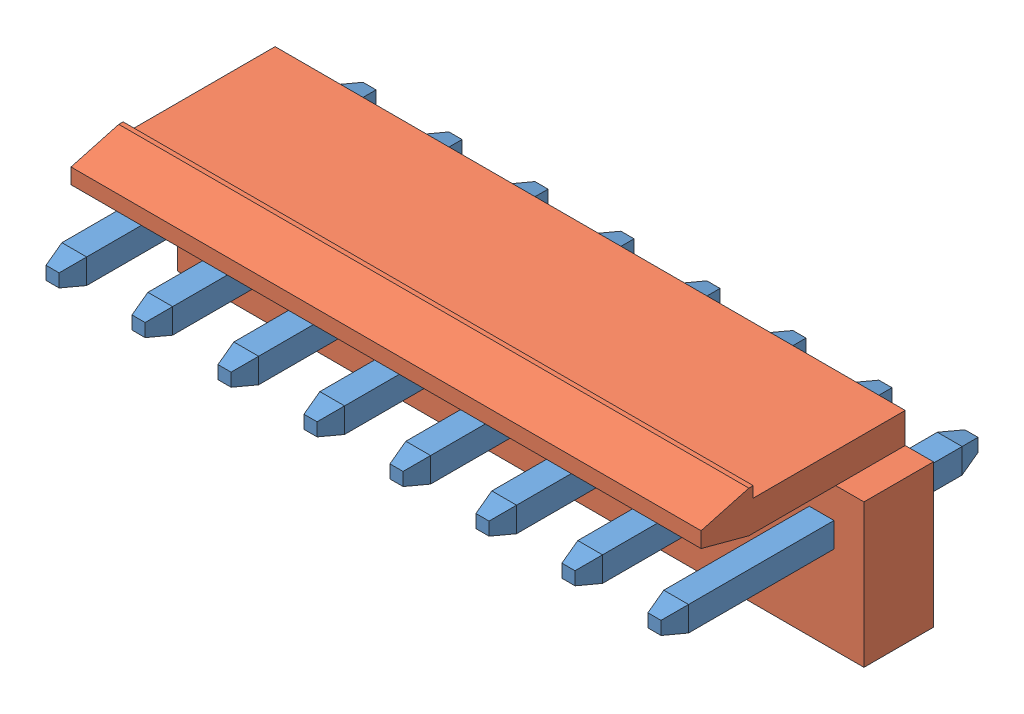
SolidWorks assembly User Library-B8P-VH-BL.sldasm, configuration Default (file format 12000). Lengths in mm.
Overall size (31.62 8.5 14.6).
9 component instances, 2 part files, 0 mates.
Components (placement in the parent):
- User Library-B8P-VH-BL_PinVH-1: User Library-B8P-VH-BL_PinVH.sldprt [Default] at (-13.86 0.35 0) size (1.14 1.14 14.6)
- User Library-B8P-VH-BL_PinVH-2: User Library-B8P-VH-BL_PinVH.sldprt [Default] at (-9.9 0.35 0) size (1.14 1.14 14.6)
- User Library-B8P-VH-BL_PinVH-3: User Library-B8P-VH-BL_PinVH.sldprt [Default] at (-5.94 0.35 0) size (1.14 1.14 14.6)
- User Library-B8P-VH-BL_PinVH-4: User Library-B8P-VH-BL_PinVH.sldprt [Default] at (-1.98 0.35 0) size (1.14 1.14 14.6)
- User Library-B8P-VH-BL_PinVH-5: User Library-B8P-VH-BL_PinVH.sldprt [Default] at (1.98 0.35 0) size (1.14 1.14 14.6)
- User Library-B8P-VH-BL_PinVH-6: User Library-B8P-VH-BL_PinVH.sldprt [Default] at (5.94 0.35 0) size (1.14 1.14 14.6)
- User Library-B8P-VH-BL_PinVH-7: User Library-B8P-VH-BL_PinVH.sldprt [Default] at (9.9 0.35 0) size (1.14 1.14 14.6)
- User Library-B8P-VH-BL_PinVH-8: User Library-B8P-VH-BL_PinVH.sldprt [Default] at (13.86 0.35 0) size (1.14 1.14 14.6)
- User Library-B8P-VH-BL_B8P-body blue-1: User Library-B8P-VH-BL_B8P-body blue.sldprt [Default] at origin size (31.62 8.5 9.4)
